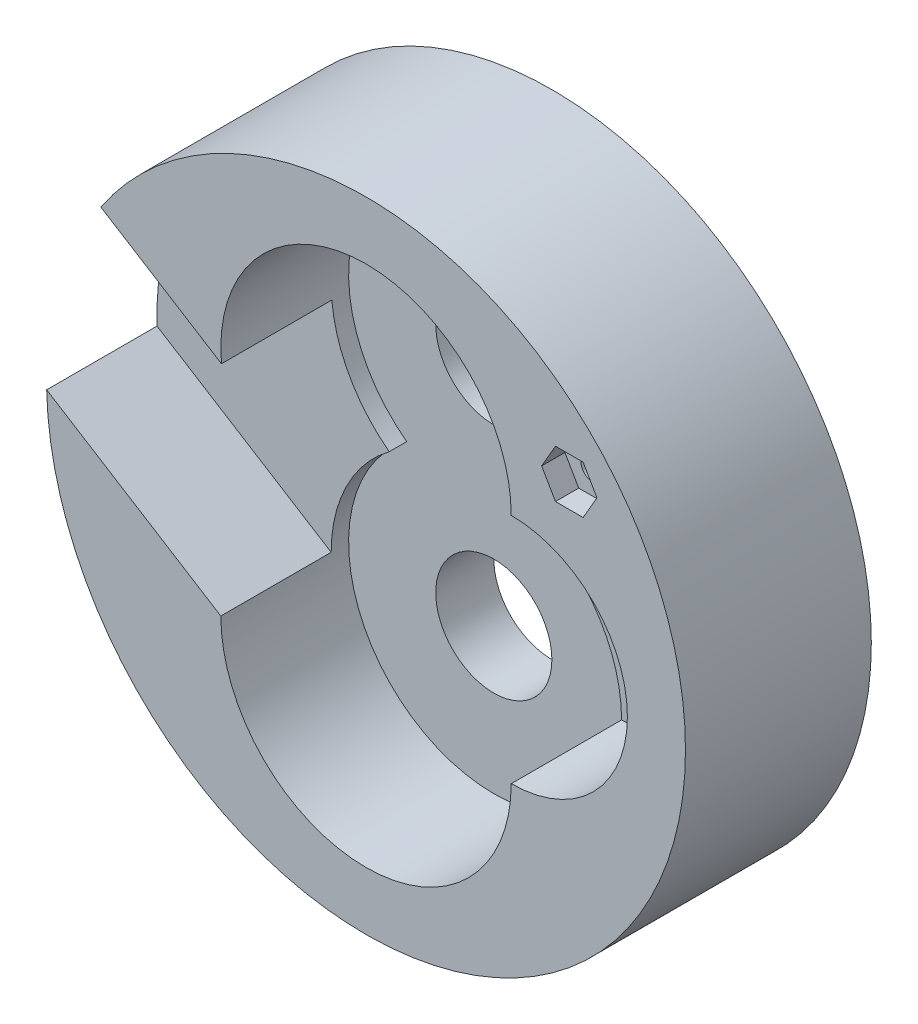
from build123d import *

# Parameters (mm, degrees)
SKETCH1_R          = 55
EXTRUDE1_DEPTH     = 32
SKETCH1_13_R       = 10
CUT_EXTRUDE1_DEPTH = 22
SKETCH1_14_R       = 10
CUT_EXTRUDE2_DEPTH = 85.107074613
CUT_EXTRUDE3_DEPTH = 19
HEX_2_DEPTH        = 4
SKETCH4_R          = 2
THRU_DEPTH         = 83.668010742


with BuildPart() as part:
    # Sketch1 → Extrude1 (new body)
    with BuildSketch(Plane.XY):
        Circle(SKETCH1_R)
    extrude(amount=-EXTRUDE1_DEPTH)

    # Sketch1_13 → Cut-Extrude1 (cut)
    with BuildSketch(Plane.XY):
        with BuildLine():
            ThreePointArc((-15, 0), (0, -45), (15, 0))
            ThreePointArc((15, 0), (0, 45), (-15, 0))
        make_face()
        with Locations((0, 20)):
            Circle(SKETCH1_13_R, mode=Mode.SUBTRACT)
        with Locations((0, -20)):
            Circle(SKETCH1_13_R, mode=Mode.SUBTRACT)
    extrude(amount=-CUT_EXTRUDE1_DEPTH, mode=Mode.SUBTRACT)

    # Sketch1_14 → Cut-Extrude2 (cut, through all)
    with BuildSketch(Plane.XY):
        with Locations((0, 20)):
            Circle(SKETCH1_14_R)
        with Locations((0, -20)):
            Circle(SKETCH1_14_R)
    extrude(amount=-CUT_EXTRUDE2_DEPTH, mode=Mode.SUBTRACT)

    # Sketch1_15 → Cut-Extrude3 (cut)
    with BuildSketch(Plane.XY):
        with BuildLine():
            ThreePointArc((-45.668792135, 30.649003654), (-52.795976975, 15.41378653), (-54.985496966, -1.262981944))
            Line((-54.985496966, -1.262981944), (-25, -20))
            ThreePointArc((-25, -20), (-22.360679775, -8.819660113), (-15, 0))
            ThreePointArc((-15, 0), (-21.813646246, 7.786694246), (-24.890758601, 17.665447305))
            Line((-24.890758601, 17.665447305), (-45.668792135, 30.649003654))
        make_face()
        with BuildLine():
            ThreePointArc((15, 0), (22.360679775, -8.819660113), (25, -20))
            ThreePointArc((25, -20), (45, 0), (25, 20))
            ThreePointArc((25, 20), (22.360679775, 8.819660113), (15, 0))
        make_face()
    extrude(amount=-CUT_EXTRUDE3_DEPTH, mode=Mode.SUBTRACT)

    # Sketch2 → Hex 2 (cut)
    with BuildSketch(Plane.XY):
        Polygon((37.38156986, 25.875), (39.763139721, 30), (37.38156986, 34.125), (32.61843014, 34.125), (30.236860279, 30), (32.61843014, 25.875), align=None)
    extrude(amount=-HEX_2_DEPTH, mode=Mode.SUBTRACT)

    # Sketch4 → Thru (cut, through all)
    with BuildSketch(Plane.XY.offset(-4)):
        with Locations((35, 30)):
            Circle(SKETCH4_R)
    extrude(amount=-THRU_DEPTH, mode=Mode.SUBTRACT)


solid = part.part
